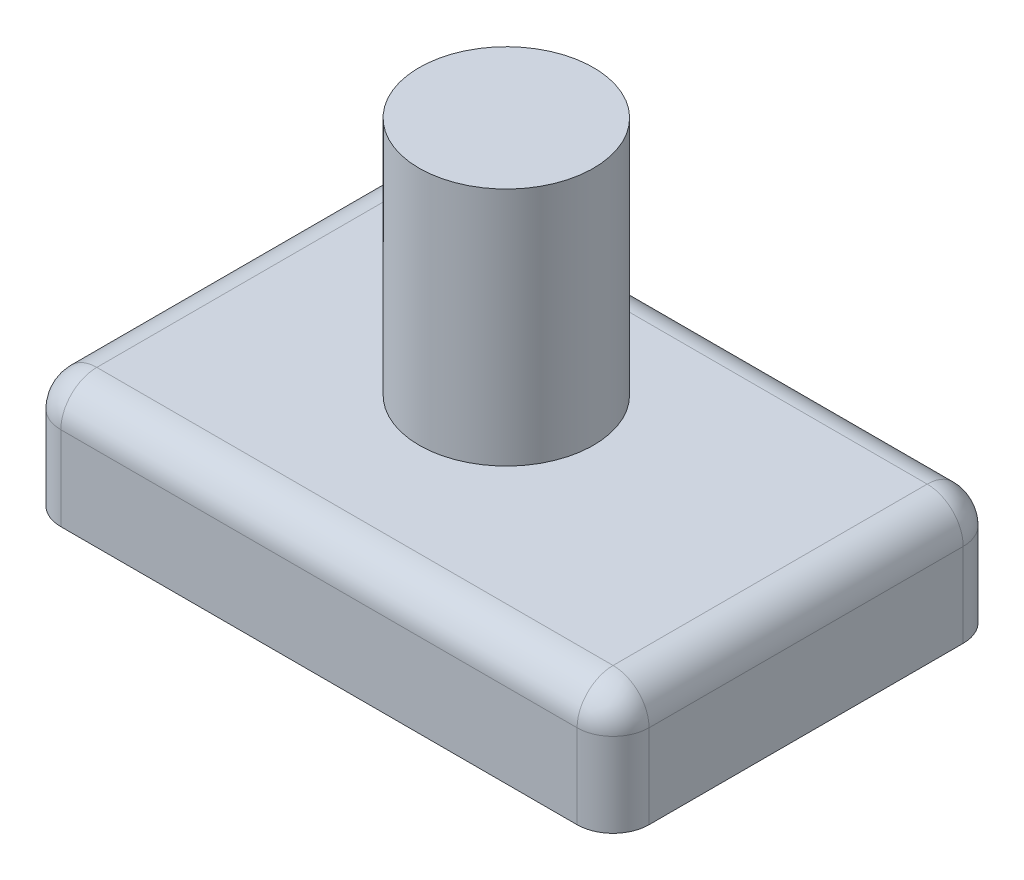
from build123d import *

# Parameters (mm, degrees)
SKETCH1_W      = 124.551807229
SKETCH1_H      = 81.752151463
EXTRUDE1_DEPTH = 25.4
SKETCH2_R      = 18.462570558
EXTRUDE2_DEPTH = 50.8
FILLET2_R      = 7.62
FILLET3_R      = 7.62


with BuildPart() as part:
    # Sketch1 → Extrude1 (new body)
    with BuildSketch(Plane(origin=(0, 0, 0), x_dir=(1, 0, 0), z_dir=(0, 1, 0))):
        with Locations((6.251635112, -5.04939759)):
            Rectangle(SKETCH1_W, SKETCH1_H)
    extrude(amount=EXTRUDE1_DEPTH)

    # Sketch2 → Extrude2 (add)
    with BuildSketch(Plane(origin=(0, 25.4, 0), x_dir=(-1, 0, 0), z_dir=(0, 1, 0))):
        with Locations(Location((0, 0, 0), (0, 0, 90))):
            Circle(SKETCH2_R)
    extrude(amount=EXTRUDE2_DEPTH)

    # Fillet2
    fillet2_edges = [part.edges().sort_by_distance(p)[0] for p in [
        (-56.024268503, 12.7, -35.826678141),
        (68.527538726, 12.7, -35.826678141),
        (68.527538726, 12.7, 45.925473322),
        (-56.024268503, 12.7, 45.925473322),
    ]]
    fillet(fillet2_edges, radius=FILLET2_R)

    # Fillet3
    fillet3_edges = [part.edges().sort_by_distance(p)[0] for p in [
        (6.251635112, 25.4, -35.826678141),
        (68.527538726, 25.4, 5.04939759),
        (-56.024268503, 25.4, 5.04939759),
        (6.251635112, 25.4, 45.925473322),
        (-53.792422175, 25.4, 43.693626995),
        (-53.792422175, 25.4, -33.594831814),
        (66.295692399, 25.4, 43.693626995),
        (66.295692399, 25.4, -33.594831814),
    ]]
    fillet(fillet3_edges, radius=FILLET3_R)


solid = part.part
